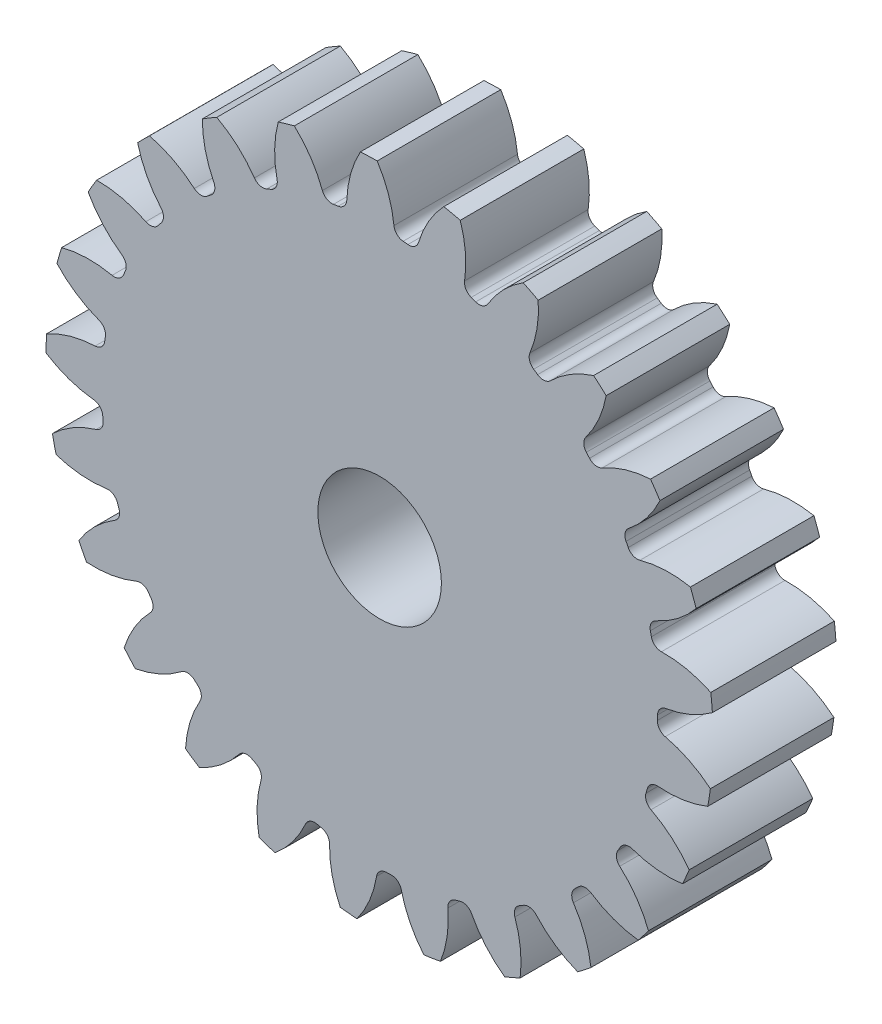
from build123d import *

# Parameters (mm, degrees)
SKETCH3_R         = 274.32
GEARBODY_DEPTH    = 101.6
TOOTHCUT_DEPTH    = 402.030528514
CIRPATTERN1_COUNT = 25
BOREDIA_R         = 50.8
BORE_DEPTH        = 12700


with BuildPart() as part:
    # Sketch3 → gearBody (new body)
    with BuildSketch(Plane.XY):
        Circle(SKETCH3_R)
    extrude(amount=GEARBODY_DEPTH)

    # Sketch2 → toothCut (cut, through all)
    with BuildSketch(Plane.XY):
        with BuildLine():
            ThreePointArc((228.426405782, -8.90713991), (228.494814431, -6.933958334), (228.546178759, -4.960259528))
            ThreePointArc((228.546178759, -4.960259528), (230.556451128, 0.267141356), (235.436661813, 3.014951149))
            ThreePointArc((235.436661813, 3.014951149), (255.879294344, 9.040153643), (274.32, 19.724004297))
            ThreePointArc((274.32, 19.724004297), (274.901629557, -8.342230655), (272.619228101, -36.321553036))
            ThreePointArc((272.619228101, -36.321553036), (254.860287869, -24.539179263), (234.820619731, -17.285491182))
            ThreePointArc((234.820619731, -17.285491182), (230.116007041, -14.246818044), (228.426405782, -8.90713991))
        make_face()
    toothcut = extrude(amount=TOOTHCUT_DEPTH, mode=Mode.SUBTRACT)

    # CirPattern1: toothCut ×25 about axis
    cirpattern1_axis = Axis((0, 0, 0), (0, 0, 1))
    for i in range(1, CIRPATTERN1_COUNT):
        add(toothcut.rotate(cirpattern1_axis, i * 360 / CIRPATTERN1_COUNT), mode=Mode.SUBTRACT)

    # boreDia → bore (cut, symmetric)
    with BuildSketch(Plane.XY):
        Circle(BOREDIA_R)
    extrude(amount=BORE_DEPTH, both=True, mode=Mode.SUBTRACT)


solid = part.part
